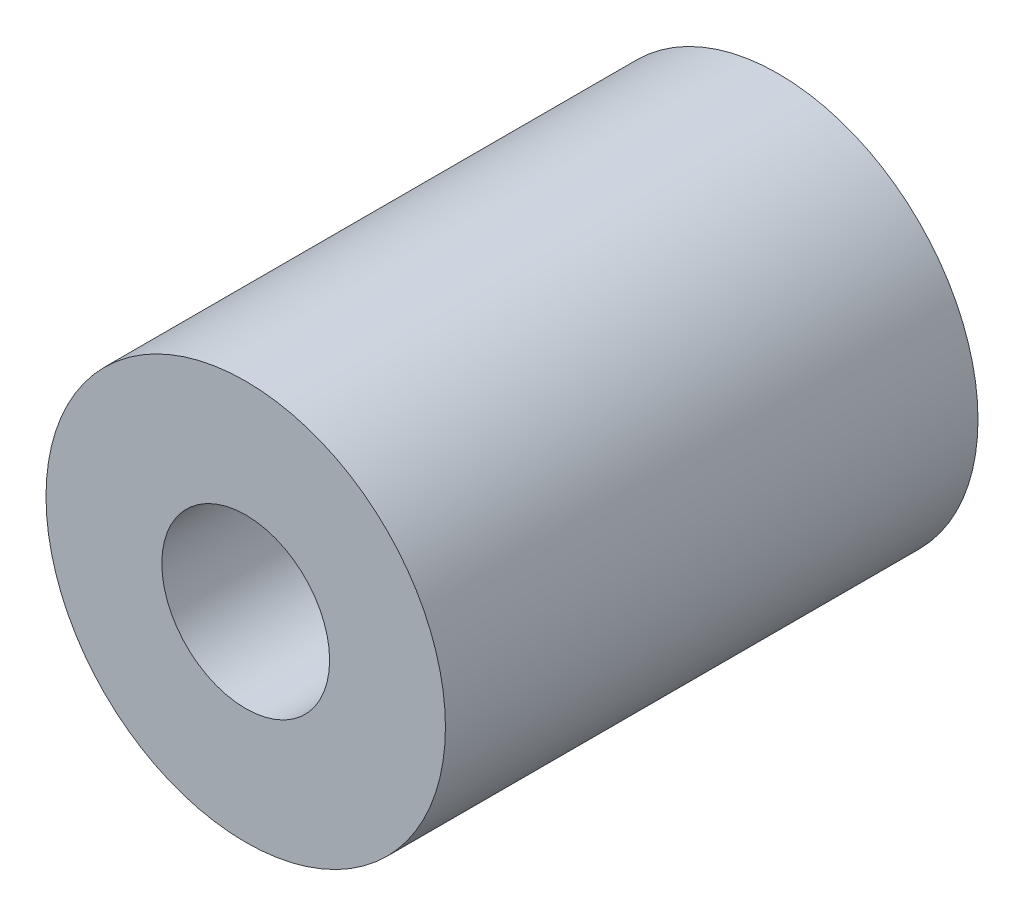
ISO-10303-21;
HEADER;
FILE_DESCRIPTION(('STEP AP214'),'2;1');
FILE_NAME('part.step','',(''),(''),'','','');
FILE_SCHEMA(('AUTOMOTIVE_DESIGN { 1 0 10303 214 1 1 1 1 }'));
ENDSEC;
DATA;
#1=APPLICATION_CONTEXT('core data for automotive mechanical design processes');
#2=APPLICATION_PROTOCOL_DEFINITION('international standard','automotive_design',2000,#1);
#3=PRODUCT_CONTEXT('',#1,'mechanical');
#4=PRODUCT('Part','Part','',(#3));
#5=PRODUCT_RELATED_PRODUCT_CATEGORY('part','',(#4));
#6=PRODUCT_DEFINITION_FORMATION('','',#4);
#7=PRODUCT_DEFINITION_CONTEXT('part definition',#1,'design');
#8=PRODUCT_DEFINITION('design','',#6,#7);
#9=PRODUCT_DEFINITION_SHAPE('','',#8);
#10=(LENGTH_UNIT() NAMED_UNIT(*) SI_UNIT(.MILLI.,.METRE.));
#11=(NAMED_UNIT(*) PLANE_ANGLE_UNIT() SI_UNIT($,.RADIAN.));
#12=(NAMED_UNIT(*) SI_UNIT($,.STERADIAN.) SOLID_ANGLE_UNIT());
#13=UNCERTAINTY_MEASURE_WITH_UNIT(LENGTH_MEASURE(1.E-05),#10,'distance_accuracy_value','');
#14=(GEOMETRIC_REPRESENTATION_CONTEXT(3) GLOBAL_UNCERTAINTY_ASSIGNED_CONTEXT((#13)) GLOBAL_UNIT_ASSIGNED_CONTEXT((#10,
#11,#12)) REPRESENTATION_CONTEXT('',''));
#15=CARTESIAN_POINT('',(0.,0.,0.));
#16=DIRECTION('',(0.,0.,1.));
#17=DIRECTION('',(1.,0.,0.));
#18=AXIS2_PLACEMENT_3D('',#15,#16,#17);
#19=CARTESIAN_POINT('',(0.,0.,25.4));
#20=DIRECTION('',(0.,0.,1.));
#21=DIRECTION('',(1.,0.,0.));
#22=AXIS2_PLACEMENT_3D('',#19,#20,#21);
#23=PLANE('',#22);
#24=CARTESIAN_POINT('',(0.,0.,25.4));
#25=DIRECTION('',(0.,0.,1.));
#26=DIRECTION('',(1.,0.,0.));
#27=AXIS2_PLACEMENT_3D('',#24,#25,#26);
#28=CIRCLE('',#27,9.525);
#29=CARTESIAN_POINT('',(9.525,0.,25.4));
#30=VERTEX_POINT('',#29);
#31=EDGE_CURVE('E10',#30,#30,#28,.T.);
#32=ORIENTED_EDGE('',*,*,#31,.T.);
#33=EDGE_LOOP('',(#32));
#34=FACE_BOUND('',#33,.T.);
#35=CARTESIAN_POINT('',(0.,0.,25.4));
#36=DIRECTION('',(0.,0.,1.));
#37=DIRECTION('',(1.,0.,0.));
#38=AXIS2_PLACEMENT_3D('',#35,#36,#37);
#39=CIRCLE('',#38,4.0005);
#40=CARTESIAN_POINT('',(4.0005,0.,25.4));
#41=VERTEX_POINT('',#40);
#42=EDGE_CURVE('E42',#41,#41,#39,.T.);
#43=ORIENTED_EDGE('',*,*,#42,.F.);
#44=EDGE_LOOP('',(#43));
#45=FACE_BOUND('',#44,.T.);
#46=ADVANCED_FACE('F31',(#34,#45),#23,.T.);
#47=CARTESIAN_POINT('',(0.,0.,0.));
#48=DIRECTION('',(0.,0.,1.));
#49=DIRECTION('',(1.,0.,0.));
#50=AXIS2_PLACEMENT_3D('',#47,#48,#49);
#51=PLANE('',#50);
#52=CARTESIAN_POINT('',(0.,0.,0.));
#53=DIRECTION('',(0.,0.,1.));
#54=DIRECTION('',(1.,0.,0.));
#55=AXIS2_PLACEMENT_3D('',#52,#53,#54);
#56=CIRCLE('',#55,9.525);
#57=CARTESIAN_POINT('',(9.525,0.,0.));
#58=VERTEX_POINT('',#57);
#59=EDGE_CURVE('E35',#58,#58,#56,.T.);
#60=ORIENTED_EDGE('',*,*,#59,.F.);
#61=EDGE_LOOP('',(#60));
#62=FACE_BOUND('',#61,.T.);
#63=CARTESIAN_POINT('',(0.,0.,0.));
#64=DIRECTION('',(0.,0.,1.));
#65=DIRECTION('',(1.,0.,0.));
#66=AXIS2_PLACEMENT_3D('',#63,#64,#65);
#67=CIRCLE('',#66,4.0005);
#68=CARTESIAN_POINT('',(4.0005,0.,0.));
#69=VERTEX_POINT('',#68);
#70=EDGE_CURVE('E44',#69,#69,#67,.T.);
#71=ORIENTED_EDGE('',*,*,#70,.T.);
#72=EDGE_LOOP('',(#71));
#73=FACE_BOUND('',#72,.T.);
#74=ADVANCED_FACE('F54',(#62,#73),#51,.F.);
#75=CARTESIAN_POINT('',(0.,0.,25.4));
#76=DIRECTION('',(0.,0.,-1.));
#77=DIRECTION('',(-1.,0.,0.));
#78=AXIS2_PLACEMENT_3D('',#75,#76,#77);
#79=CYLINDRICAL_SURFACE('',#78,9.525);
#80=ORIENTED_EDGE('',*,*,#31,.F.);
#81=EDGE_LOOP('',(#80));
#82=FACE_BOUND('',#81,.T.);
#83=ORIENTED_EDGE('',*,*,#59,.T.);
#84=EDGE_LOOP('',(#83));
#85=FACE_BOUND('',#84,.T.);
#86=ADVANCED_FACE('F33',(#82,#85),#79,.T.);
#87=CARTESIAN_POINT('',(0.,0.,25.4));
#88=DIRECTION('',(0.,0.,-1.));
#89=DIRECTION('',(-1.,0.,0.));
#90=AXIS2_PLACEMENT_3D('',#87,#88,#89);
#91=CYLINDRICAL_SURFACE('',#90,4.0005);
#92=ORIENTED_EDGE('',*,*,#42,.T.);
#93=EDGE_LOOP('',(#92));
#94=FACE_BOUND('',#93,.T.);
#95=ORIENTED_EDGE('',*,*,#70,.F.);
#96=EDGE_LOOP('',(#95));
#97=FACE_BOUND('',#96,.T.);
#98=ADVANCED_FACE('F50',(#94,#97),#91,.F.);
#99=CLOSED_SHELL('',(#46,#74,#86,#98));
#100=MANIFOLD_SOLID_BREP('B2',#99);
#101=ADVANCED_BREP_SHAPE_REPRESENTATION('',(#18,#100),#14);
#102=SHAPE_DEFINITION_REPRESENTATION(#9,#101);
ENDSEC;
END-ISO-10303-21;
